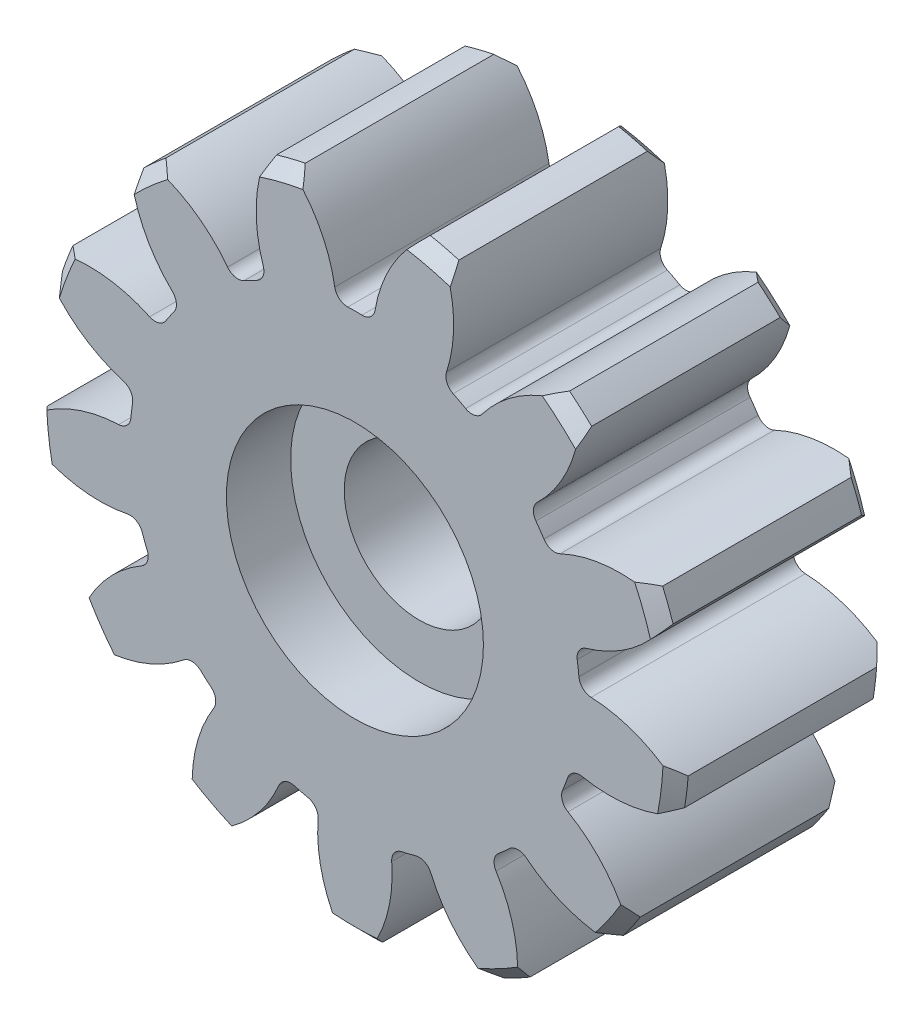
from build123d import *

# Parameters (mm, degrees)
SKETCH3_R                = 15
BOSS_EXTRUDE1_DEPTH      = 10
CUT_EXTRUDE1_START       = -10
CUT_EXTRUDE1_DEPTH       = 10
FILLET1_R                = 0.6
CHAMFER1_SIZE            = 0.6
CIRPATTERN1_COUNT        = 13
FILLET1_OF_CIRPATTERN1_R = 0.6
SKETCH8_R                = 3.5
CUT_EXTRUDE2_DEPTH       = 10
SKETCH9_R                = 6
CUT_EXTRUDE3_DEPTH       = 3


with BuildPart() as part:
    # Sketch3 → Boss-Extrude1 (new body)
    with BuildSketch(Plane.XY):
        Circle(SKETCH3_R)
    extrude(amount=BOSS_EXTRUDE1_DEPTH)

    # Sketch5 → Cut-Extrude1 (cut)
    with BuildSketch(Plane.XY.offset(10).offset(CUT_EXTRUDE1_START)):
        with BuildLine():
            ThreePointArc((-0.873832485, 10.463575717), (-1.503654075, 12.777110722), (-2.917698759, 14.713498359))
            ThreePointArc((-2.917698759, 14.713498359), (0, 15), (2.917698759, 14.713498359))
            ThreePointArc((2.917698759, 14.713498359), (1.503654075, 12.777110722), (0.873832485, 10.463575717))
            ThreePointArc((0.873832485, 10.463575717), (0, 10.5), (-0.873832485, 10.463575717))
        make_face()
    cut_extrude1 = extrude(amount=CUT_EXTRUDE1_DEPTH, mode=Mode.SUBTRACT)

    # Fillet1
    fillet1_edges = [part.edges().sort_by_distance(p)[0] for p in [
        (0.873832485, 10.463575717, 5),
        (-0.873832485, 10.463575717, 5),
    ]]
    fillet(fillet1_edges, radius=FILLET1_R)

    # Chamfer1
    chamfer1_edges = [part.edges().sort_by_distance(p)[0] for p in [
        (0, -15, 0),
        (0, -15, 10),
    ]]
    chamfer(chamfer1_edges, length=CHAMFER1_SIZE)

    # CirPattern1: Cut-Extrude1 ×13 about axis
    cirpattern1_axis = Axis((0, 0, 0), (0, 0, 1))
    for i in range(1, CIRPATTERN1_COUNT):
        add(cut_extrude1.rotate(cirpattern1_axis, i * 360 / CIRPATTERN1_COUNT), mode=Mode.SUBTRACT)

    # Fillet1 of CirPattern1
    fillet1_of_cirpattern1_edges = [part.edges().sort_by_distance(p)[0] for p in [
        (-4.088925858, 9.671126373, 5),
        (-5.636406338, 8.858945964, 5),
        (-8.114960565, 6.663138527, 5),
        (-9.107747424, 5.224838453, 5),
        (-10.281955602, 2.128705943, 5),
        (-10.492613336, 0.393783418, 5),
        (-10.093478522, -2.893387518, 5),
        (-9.473747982, -4.527482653, 5),
        (-7.592707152, -7.252640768, 5),
        (-6.284561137, -8.411557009, 5),
        (-3.352538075, -9.950401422, 5),
        (-1.655657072, -10.368645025, 5),
        (1.655657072, -10.368645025, 5),
        (3.352538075, -9.950401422, 5),
        (6.284561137, -8.411557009, 5),
        (7.592707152, -7.252640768, 5),
        (9.473747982, -4.527482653, 5),
        (10.093478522, -2.893387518, 5),
        (10.492613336, 0.393783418, 5),
        (10.281955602, 2.128705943, 5),
        (9.107747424, 5.224838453, 5),
        (8.114960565, 6.663138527, 5),
        (5.636406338, 8.858945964, 5),
        (4.088925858, 9.671126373, 5),
    ]]
    fillet(fillet1_of_cirpattern1_edges, radius=FILLET1_OF_CIRPATTERN1_R)

    # Sketch8 → Cut-Extrude2 (cut)
    with BuildSketch(Plane.XY.offset(10)):
        Circle(SKETCH8_R)
    extrude(amount=-CUT_EXTRUDE2_DEPTH, mode=Mode.SUBTRACT)

    # Sketch9 → Cut-Extrude3 (cut)
    with BuildSketch(Plane.XY.offset(10)):
        Circle(SKETCH9_R)
    extrude(amount=-CUT_EXTRUDE3_DEPTH, mode=Mode.SUBTRACT)


solid = part.part
